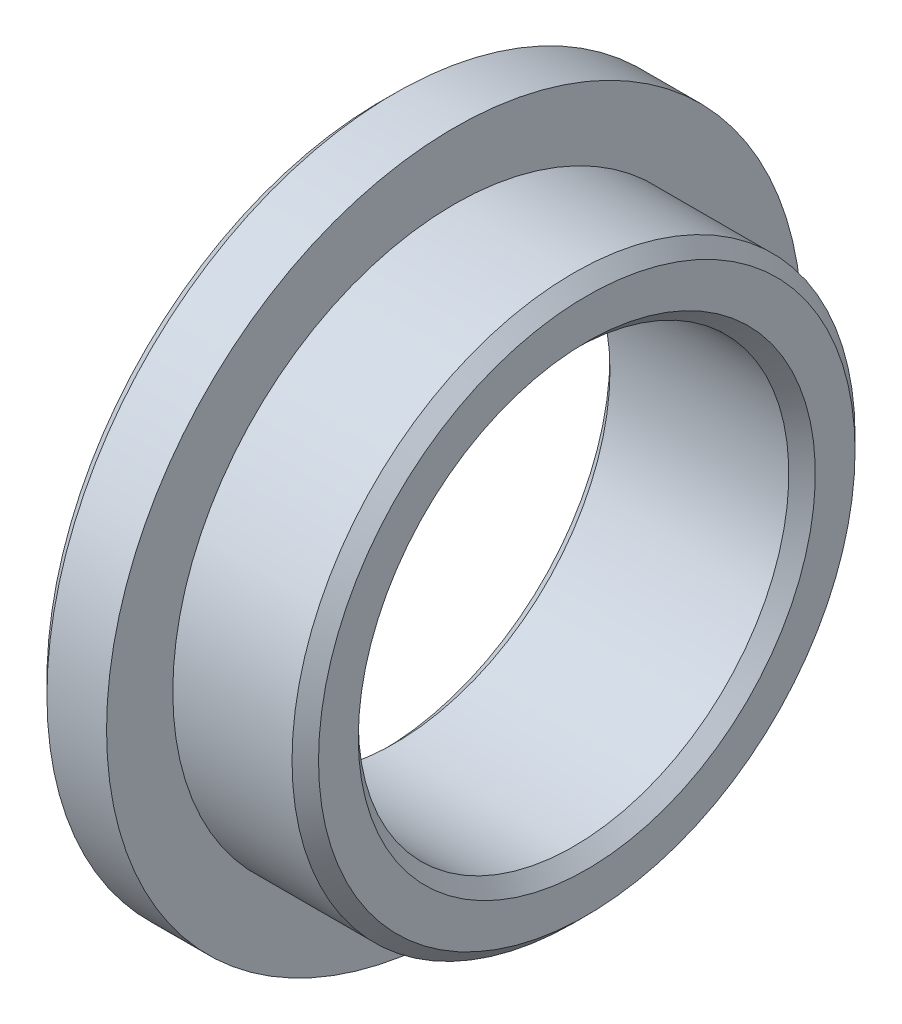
from build123d import *

# Parameters (mm, degrees)
CHANFREIN1_SIZE = 2


with BuildPart() as part:
    # Esquisse1 → Base-R_volution (revolve)
    with BuildSketch(Plane.XY, mode=Mode.PRIVATE) as base_r_volution_sk:
        Polygon((-11, 52.5), (0, 52.5), (0, 42.5), (20, 42.5), (20, 32.5), (-11, 32.5), align=None)
    revolve(base_r_volution_sk.sketch.rotate(Axis((-17.73968254, 0, 0), (1, 0, 0)), 90), axis=Axis((-17.73968254, 0, 0), (1, 0, 0)))

    # Chanfrein1
    chanfrein1_edges = [part.edges().sort_by_distance(p)[0] for p in [
        (-11, 0, -52.5),
        (20, 0, -42.5),
        (20, 0, -32.5),
        (-11, 0, -32.5),
    ]]
    chamfer(chanfrein1_edges, length=CHANFREIN1_SIZE)


solid = part.part
